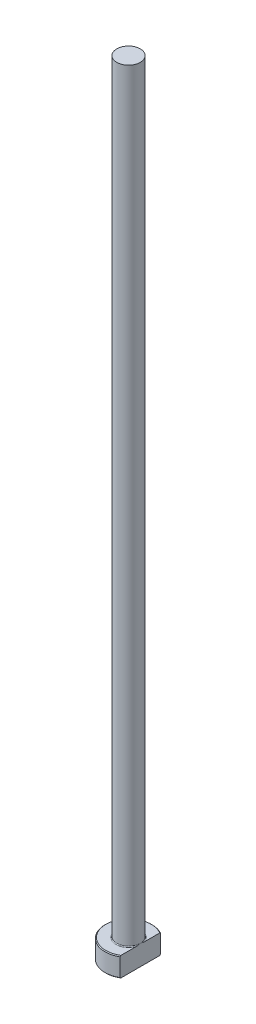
from build123d import *
from build123d.topology import SkipClean

# Parameters (mm, degrees)
CHAMFER1_SIZE = 0.2
FILLET1_R     = 0.2
KEY_DEPTH     = 201.179919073


with BuildPart() as part:
    # Sketch1 → Revolve1 (revolve)
    with BuildSketch(Plane.XY, mode=Mode.PRIVATE) as revolve1_sk:
        Polygon((0, 0), (-6, 0), (-6, 5), (-3, 5), (-3, 200), (0, 200), align=None)
    revolve(revolve1_sk.sketch.rotate(Axis((0, 259.958771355, 0), (0, -1, 0)), 270), axis=Axis((0, 259.958771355, 0), (0, -1, 0)))

    # Chamfer1
    chamfer1_edges = [part.edges().sort_by_distance(p)[0] for p in [
        (0, 5, -6),
        (0, 0, -6),
    ]]
    chamfer(chamfer1_edges, length=CHAMFER1_SIZE)

    # Fillet1
    fillet1_edges = [part.edges().sort_by_distance(p)[0] for p in [
        (0, 5, -3),
    ]]
    fillet(fillet1_edges, radius=FILLET1_R)

    # Sketch2 → KEY (cut, through all)
    with SkipClean():  # the faces are left unmerged after this step: merging them gives an invalid solid
        with BuildSketch(Plane(origin=(0, 0, 0), x_dir=(1, 0, 0), z_dir=(0, 1, 0))):
            with BuildLine():
                Line((3, 5.196152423), (3, -5.196152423))
                ThreePointArc((3, -5.196152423), (6, 0), (3, 5.196152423))
            make_face()
        extrude(amount=KEY_DEPTH, mode=Mode.SUBTRACT)


solid = part.part
